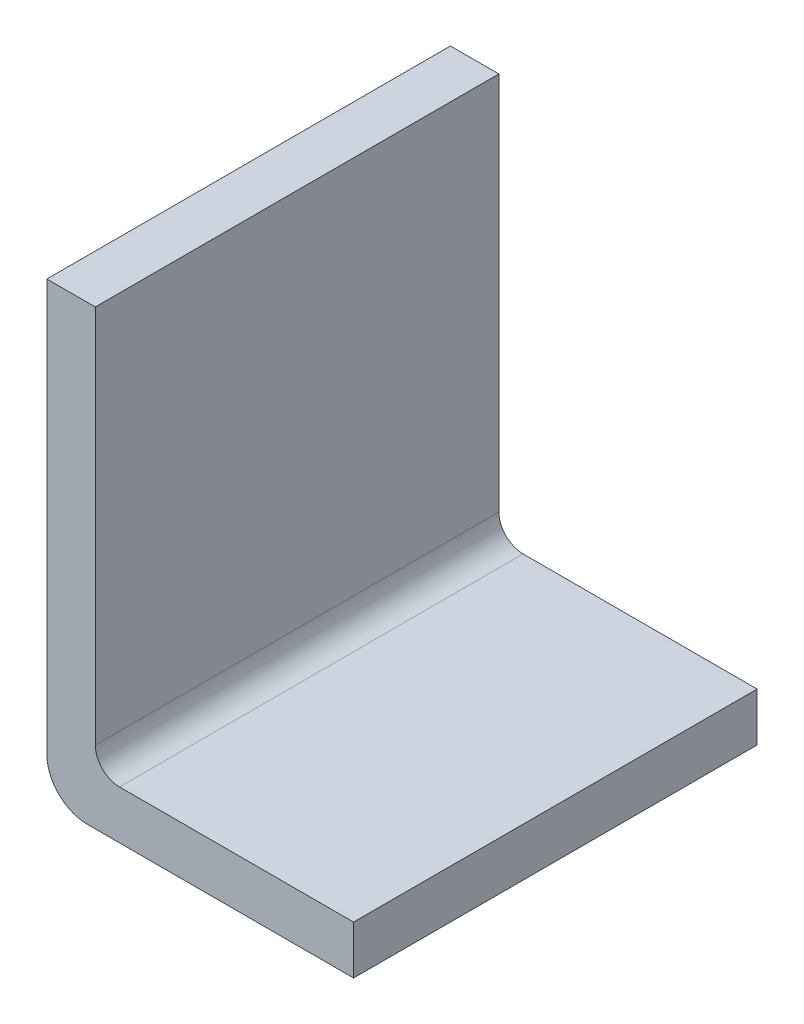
ISO-10303-21;
HEADER;
FILE_DESCRIPTION(('STEP AP214'),'2;1');
FILE_NAME('part.step','',(''),(''),'','','');
FILE_SCHEMA(('AUTOMOTIVE_DESIGN { 1 0 10303 214 1 1 1 1 }'));
ENDSEC;
DATA;
#1=APPLICATION_CONTEXT('core data for automotive mechanical design processes');
#2=APPLICATION_PROTOCOL_DEFINITION('international standard','automotive_design',2000,#1);
#3=PRODUCT_CONTEXT('',#1,'mechanical');
#4=PRODUCT('Part','Part','',(#3));
#5=PRODUCT_RELATED_PRODUCT_CATEGORY('part','',(#4));
#6=PRODUCT_DEFINITION_FORMATION('','',#4);
#7=PRODUCT_DEFINITION_CONTEXT('part definition',#1,'design');
#8=PRODUCT_DEFINITION('design','',#6,#7);
#9=PRODUCT_DEFINITION_SHAPE('','',#8);
#10=(LENGTH_UNIT() NAMED_UNIT(*) SI_UNIT(.MILLI.,.METRE.));
#11=(NAMED_UNIT(*) PLANE_ANGLE_UNIT() SI_UNIT($,.RADIAN.));
#12=(NAMED_UNIT(*) SI_UNIT($,.STERADIAN.) SOLID_ANGLE_UNIT());
#13=UNCERTAINTY_MEASURE_WITH_UNIT(LENGTH_MEASURE(1.E-05),#10,'distance_accuracy_value','');
#14=(GEOMETRIC_REPRESENTATION_CONTEXT(3) GLOBAL_UNCERTAINTY_ASSIGNED_CONTEXT((#13)) GLOBAL_UNIT_ASSIGNED_CONTEXT((#10,
#11,#12)) REPRESENTATION_CONTEXT('',''));
#15=CARTESIAN_POINT('',(0.,0.,0.));
#16=DIRECTION('',(0.,0.,1.));
#17=DIRECTION('',(1.,0.,0.));
#18=AXIS2_PLACEMENT_3D('',#15,#16,#17);
#19=CARTESIAN_POINT('',(6.,56.,50.));
#20=DIRECTION('',(0.,-1.,0.));
#21=DIRECTION('',(0.,0.,-1.));
#22=AXIS2_PLACEMENT_3D('',#19,#20,#21);
#23=PLANE('',#22);
#24=DIRECTION('',(-1.,0.,0.));
#25=VECTOR('',#24,1.);
#26=CARTESIAN_POINT('',(6.,56.,0.));
#27=LINE('',#26,#25);
#28=CARTESIAN_POINT('',(6.,56.,0.));
#29=VERTEX_POINT('',#28);
#30=CARTESIAN_POINT('',(0.,56.,0.));
#31=VERTEX_POINT('',#30);
#32=EDGE_CURVE('E135',#29,#31,#27,.T.);
#33=ORIENTED_EDGE('',*,*,#32,.T.);
#34=DIRECTION('',(0.,0.,-1.));
#35=VECTOR('',#34,1.);
#36=CARTESIAN_POINT('',(0.,56.,50.));
#37=LINE('',#36,#35);
#38=CARTESIAN_POINT('',(0.,56.,50.));
#39=VERTEX_POINT('',#38);
#40=EDGE_CURVE('E11',#39,#31,#37,.T.);
#41=ORIENTED_EDGE('',*,*,#40,.F.);
#42=DIRECTION('',(-1.,0.,0.));
#43=VECTOR('',#42,1.);
#44=CARTESIAN_POINT('',(6.,56.,50.));
#45=LINE('',#44,#43);
#46=CARTESIAN_POINT('',(6.,56.,50.));
#47=VERTEX_POINT('',#46);
#48=EDGE_CURVE('E149',#47,#39,#45,.T.);
#49=ORIENTED_EDGE('',*,*,#48,.F.);
#50=DIRECTION('',(0.,0.,-1.));
#51=VECTOR('',#50,1.);
#52=CARTESIAN_POINT('',(6.,56.,50.));
#53=LINE('',#52,#51);
#54=EDGE_CURVE('E131',#47,#29,#53,.T.);
#55=ORIENTED_EDGE('',*,*,#54,.T.);
#56=EDGE_LOOP('',(#33,#41,#49,#55));
#57=FACE_BOUND('',#56,.T.);
#58=ADVANCED_FACE('F39',(#57),#23,.F.);
#59=CARTESIAN_POINT('',(0.,56.,50.));
#60=DIRECTION('',(1.,0.,0.));
#61=DIRECTION('',(0.,1.,0.));
#62=AXIS2_PLACEMENT_3D('',#59,#60,#61);
#63=PLANE('',#62);
#64=DIRECTION('',(0.,-1.,0.));
#65=VECTOR('',#64,1.);
#66=CARTESIAN_POINT('',(0.,56.,0.));
#67=LINE('',#66,#65);
#68=CARTESIAN_POINT('',(0.,5.,0.));
#69=VERTEX_POINT('',#68);
#70=EDGE_CURVE('E138',#31,#69,#67,.T.);
#71=ORIENTED_EDGE('',*,*,#70,.T.);
#72=DIRECTION('',(0.,0.,-1.));
#73=VECTOR('',#72,1.);
#74=CARTESIAN_POINT('',(0.,5.,50.));
#75=LINE('',#74,#73);
#76=CARTESIAN_POINT('',(0.,5.,50.));
#77=VERTEX_POINT('',#76);
#78=EDGE_CURVE('E47',#77,#69,#75,.T.);
#79=ORIENTED_EDGE('',*,*,#78,.F.);
#80=DIRECTION('',(0.,-1.,0.));
#81=VECTOR('',#80,1.);
#82=CARTESIAN_POINT('',(0.,56.,50.));
#83=LINE('',#82,#81);
#84=EDGE_CURVE('E98',#39,#77,#83,.T.);
#85=ORIENTED_EDGE('',*,*,#84,.F.);
#86=ORIENTED_EDGE('',*,*,#40,.T.);
#87=EDGE_LOOP('',(#71,#79,#85,#86));
#88=FACE_BOUND('',#87,.T.);
#89=ADVANCED_FACE('F184',(#88),#63,.F.);
#90=CARTESIAN_POINT('',(5.00000000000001,5.,50.));
#91=DIRECTION('',(0.,0.,-1.));
#92=DIRECTION('',(-1.,0.,0.));
#93=AXIS2_PLACEMENT_3D('',#90,#91,#92);
#94=CYLINDRICAL_SURFACE('',#93,5.);
#95=CARTESIAN_POINT('',(5.00000000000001,5.,0.));
#96=DIRECTION('',(0.,0.,1.));
#97=DIRECTION('',(1.,0.,0.));
#98=AXIS2_PLACEMENT_3D('',#95,#96,#97);
#99=CIRCLE('',#98,5.);
#100=CARTESIAN_POINT('',(5.00000000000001,0.,0.));
#101=VERTEX_POINT('',#100);
#102=EDGE_CURVE('E140',#69,#101,#99,.T.);
#103=ORIENTED_EDGE('',*,*,#102,.T.);
#104=DIRECTION('',(0.,0.,-1.));
#105=VECTOR('',#104,1.);
#106=CARTESIAN_POINT('',(5.00000000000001,0.,50.));
#107=LINE('',#106,#105);
#108=CARTESIAN_POINT('',(5.00000000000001,0.,50.));
#109=VERTEX_POINT('',#108);
#110=EDGE_CURVE('E156',#109,#101,#107,.T.);
#111=ORIENTED_EDGE('',*,*,#110,.F.);
#112=CARTESIAN_POINT('',(5.00000000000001,5.,50.));
#113=DIRECTION('',(0.,0.,1.));
#114=DIRECTION('',(1.,0.,0.));
#115=AXIS2_PLACEMENT_3D('',#112,#113,#114);
#116=CIRCLE('',#115,5.);
#117=EDGE_CURVE('E164',#77,#109,#116,.T.);
#118=ORIENTED_EDGE('',*,*,#117,.F.);
#119=ORIENTED_EDGE('',*,*,#78,.T.);
#120=EDGE_LOOP('',(#103,#111,#118,#119));
#121=FACE_BOUND('',#120,.T.);
#122=ADVANCED_FACE('F162',(#121),#94,.T.);
#123=CARTESIAN_POINT('',(5.00000000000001,0.,50.));
#124=DIRECTION('',(0.,1.,0.));
#125=DIRECTION('',(0.,0.,1.));
#126=AXIS2_PLACEMENT_3D('',#123,#124,#125);
#127=PLANE('',#126);
#128=DIRECTION('',(1.,0.,0.));
#129=VECTOR('',#128,1.);
#130=CARTESIAN_POINT('',(5.00000000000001,0.,0.));
#131=LINE('',#130,#129);
#132=CARTESIAN_POINT('',(38.,0.,0.));
#133=VERTEX_POINT('',#132);
#134=EDGE_CURVE('E142',#101,#133,#131,.T.);
#135=ORIENTED_EDGE('',*,*,#134,.T.);
#136=DIRECTION('',(0.,0.,-1.));
#137=VECTOR('',#136,1.);
#138=CARTESIAN_POINT('',(38.,0.,50.));
#139=LINE('',#138,#137);
#140=CARTESIAN_POINT('',(38.,0.,50.));
#141=VERTEX_POINT('',#140);
#142=EDGE_CURVE('E153',#141,#133,#139,.T.);
#143=ORIENTED_EDGE('',*,*,#142,.F.);
#144=DIRECTION('',(1.,0.,0.));
#145=VECTOR('',#144,1.);
#146=CARTESIAN_POINT('',(5.00000000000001,0.,50.));
#147=LINE('',#146,#145);
#148=EDGE_CURVE('E176',#109,#141,#147,.T.);
#149=ORIENTED_EDGE('',*,*,#148,.F.);
#150=ORIENTED_EDGE('',*,*,#110,.T.);
#151=EDGE_LOOP('',(#135,#143,#149,#150));
#152=FACE_BOUND('',#151,.T.);
#153=ADVANCED_FACE('F172',(#152),#127,.F.);
#154=CARTESIAN_POINT('',(38.,0.,50.));
#155=DIRECTION('',(-1.,0.,0.));
#156=DIRECTION('',(0.,0.,1.));
#157=AXIS2_PLACEMENT_3D('',#154,#155,#156);
#158=PLANE('',#157);
#159=DIRECTION('',(0.,1.,0.));
#160=VECTOR('',#159,1.);
#161=CARTESIAN_POINT('',(38.,0.,0.));
#162=LINE('',#161,#160);
#163=CARTESIAN_POINT('',(38.,6.,0.));
#164=VERTEX_POINT('',#163);
#165=EDGE_CURVE('E144',#133,#164,#162,.T.);
#166=ORIENTED_EDGE('',*,*,#165,.T.);
#167=DIRECTION('',(0.,0.,-1.));
#168=VECTOR('',#167,1.);
#169=CARTESIAN_POINT('',(38.,6.,50.));
#170=LINE('',#169,#168);
#171=CARTESIAN_POINT('',(38.,6.,50.));
#172=VERTEX_POINT('',#171);
#173=EDGE_CURVE('E126',#172,#164,#170,.T.);
#174=ORIENTED_EDGE('',*,*,#173,.F.);
#175=DIRECTION('',(0.,1.,0.));
#176=VECTOR('',#175,1.);
#177=CARTESIAN_POINT('',(38.,0.,50.));
#178=LINE('',#177,#176);
#179=EDGE_CURVE('E117',#141,#172,#178,.T.);
#180=ORIENTED_EDGE('',*,*,#179,.F.);
#181=ORIENTED_EDGE('',*,*,#142,.T.);
#182=EDGE_LOOP('',(#166,#174,#180,#181));
#183=FACE_BOUND('',#182,.T.);
#184=ADVANCED_FACE('F175',(#183),#158,.F.);
#185=CARTESIAN_POINT('',(38.,6.,50.));
#186=DIRECTION('',(0.,-1.,0.));
#187=DIRECTION('',(1.,0.,0.));
#188=AXIS2_PLACEMENT_3D('',#185,#186,#187);
#189=PLANE('',#188);
#190=DIRECTION('',(-1.,0.,0.));
#191=VECTOR('',#190,1.);
#192=CARTESIAN_POINT('',(38.,6.,0.));
#193=LINE('',#192,#191);
#194=CARTESIAN_POINT('',(9.,6.,0.));
#195=VERTEX_POINT('',#194);
#196=EDGE_CURVE('E125',#164,#195,#193,.T.);
#197=ORIENTED_EDGE('',*,*,#196,.T.);
#198=DIRECTION('',(0.,0.,-1.));
#199=VECTOR('',#198,1.);
#200=CARTESIAN_POINT('',(9.,6.,50.));
#201=LINE('',#200,#199);
#202=CARTESIAN_POINT('',(9.,6.,50.));
#203=VERTEX_POINT('',#202);
#204=EDGE_CURVE('E122',#203,#195,#201,.T.);
#205=ORIENTED_EDGE('',*,*,#204,.F.);
#206=DIRECTION('',(-1.,0.,0.));
#207=VECTOR('',#206,1.);
#208=CARTESIAN_POINT('',(38.,6.,50.));
#209=LINE('',#208,#207);
#210=EDGE_CURVE('E111',#172,#203,#209,.T.);
#211=ORIENTED_EDGE('',*,*,#210,.F.);
#212=ORIENTED_EDGE('',*,*,#173,.T.);
#213=EDGE_LOOP('',(#197,#205,#211,#212));
#214=FACE_BOUND('',#213,.T.);
#215=ADVANCED_FACE('F123',(#214),#189,.F.);
#216=CARTESIAN_POINT('',(9.,9.,50.));
#217=DIRECTION('',(0.,0.,-1.));
#218=DIRECTION('',(-1.,0.,0.));
#219=AXIS2_PLACEMENT_3D('',#216,#217,#218);
#220=CYLINDRICAL_SURFACE('',#219,3.);
#221=CARTESIAN_POINT('',(9.,9.,0.));
#222=DIRECTION('',(0.,0.,-1.));
#223=DIRECTION('',(-1.,0.,0.));
#224=AXIS2_PLACEMENT_3D('',#221,#222,#223);
#225=CIRCLE('',#224,3.);
#226=CARTESIAN_POINT('',(6.,9.,0.));
#227=VERTEX_POINT('',#226);
#228=EDGE_CURVE('E84',#195,#227,#225,.T.);
#229=ORIENTED_EDGE('',*,*,#228,.T.);
#230=DIRECTION('',(0.,0.,-1.));
#231=VECTOR('',#230,1.);
#232=CARTESIAN_POINT('',(6.,9.,50.));
#233=LINE('',#232,#231);
#234=CARTESIAN_POINT('',(6.,9.,50.));
#235=VERTEX_POINT('',#234);
#236=EDGE_CURVE('E127',#235,#227,#233,.T.);
#237=ORIENTED_EDGE('',*,*,#236,.F.);
#238=CARTESIAN_POINT('',(9.,9.,50.));
#239=DIRECTION('',(0.,0.,-1.));
#240=DIRECTION('',(-1.,0.,0.));
#241=AXIS2_PLACEMENT_3D('',#238,#239,#240);
#242=CIRCLE('',#241,3.);
#243=EDGE_CURVE('E115',#203,#235,#242,.T.);
#244=ORIENTED_EDGE('',*,*,#243,.F.);
#245=ORIENTED_EDGE('',*,*,#204,.T.);
#246=EDGE_LOOP('',(#229,#237,#244,#245));
#247=FACE_BOUND('',#246,.T.);
#248=ADVANCED_FACE('F129',(#247),#220,.F.);
#249=CARTESIAN_POINT('',(6.,9.,50.));
#250=DIRECTION('',(-1.,0.,0.));
#251=DIRECTION('',(0.,0.,1.));
#252=AXIS2_PLACEMENT_3D('',#249,#250,#251);
#253=PLANE('',#252);
#254=DIRECTION('',(0.,1.,0.));
#255=VECTOR('',#254,1.);
#256=CARTESIAN_POINT('',(6.,9.,0.));
#257=LINE('',#256,#255);
#258=EDGE_CURVE('E90',#227,#29,#257,.T.);
#259=ORIENTED_EDGE('',*,*,#258,.T.);
#260=ORIENTED_EDGE('',*,*,#54,.F.);
#261=DIRECTION('',(0.,1.,0.));
#262=VECTOR('',#261,1.);
#263=CARTESIAN_POINT('',(6.,9.,50.));
#264=LINE('',#263,#262);
#265=EDGE_CURVE('E55',#235,#47,#264,.T.);
#266=ORIENTED_EDGE('',*,*,#265,.F.);
#267=ORIENTED_EDGE('',*,*,#236,.T.);
#268=EDGE_LOOP('',(#259,#260,#266,#267));
#269=FACE_BOUND('',#268,.T.);
#270=ADVANCED_FACE('F200',(#269),#253,.F.);
#271=CARTESIAN_POINT('',(5.00000000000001,5.,50.));
#272=DIRECTION('',(0.,0.,1.));
#273=DIRECTION('',(1.,0.,0.));
#274=AXIS2_PLACEMENT_3D('',#271,#272,#273);
#275=PLANE('',#274);
#276=ORIENTED_EDGE('',*,*,#48,.T.);
#277=ORIENTED_EDGE('',*,*,#84,.T.);
#278=ORIENTED_EDGE('',*,*,#117,.T.);
#279=ORIENTED_EDGE('',*,*,#148,.T.);
#280=ORIENTED_EDGE('',*,*,#179,.T.);
#281=ORIENTED_EDGE('',*,*,#210,.T.);
#282=ORIENTED_EDGE('',*,*,#243,.T.);
#283=ORIENTED_EDGE('',*,*,#265,.T.);
#284=EDGE_LOOP('',(#276,#277,#278,#279,#280,#281,#282,#283));
#285=FACE_BOUND('',#284,.T.);
#286=ADVANCED_FACE('F113',(#285),#275,.T.);
#287=CARTESIAN_POINT('',(5.00000000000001,5.,0.));
#288=DIRECTION('',(0.,0.,1.));
#289=DIRECTION('',(1.,0.,0.));
#290=AXIS2_PLACEMENT_3D('',#287,#288,#289);
#291=PLANE('',#290);
#292=ORIENTED_EDGE('',*,*,#32,.F.);
#293=ORIENTED_EDGE('',*,*,#258,.F.);
#294=ORIENTED_EDGE('',*,*,#228,.F.);
#295=ORIENTED_EDGE('',*,*,#196,.F.);
#296=ORIENTED_EDGE('',*,*,#165,.F.);
#297=ORIENTED_EDGE('',*,*,#134,.F.);
#298=ORIENTED_EDGE('',*,*,#102,.F.);
#299=ORIENTED_EDGE('',*,*,#70,.F.);
#300=EDGE_LOOP('',(#292,#293,#294,#295,#296,#297,#298,#299));
#301=FACE_BOUND('',#300,.T.);
#302=ADVANCED_FACE('F168',(#301),#291,.F.);
#303=CLOSED_SHELL('',(#58,#89,#122,#153,#184,#215,#248,#270,#286,#302));
#304=MANIFOLD_SOLID_BREP('B2',#303);
#305=ADVANCED_BREP_SHAPE_REPRESENTATION('',(#18,#304),#14);
#306=SHAPE_DEFINITION_REPRESENTATION(#9,#305);
ENDSEC;
END-ISO-10303-21;
